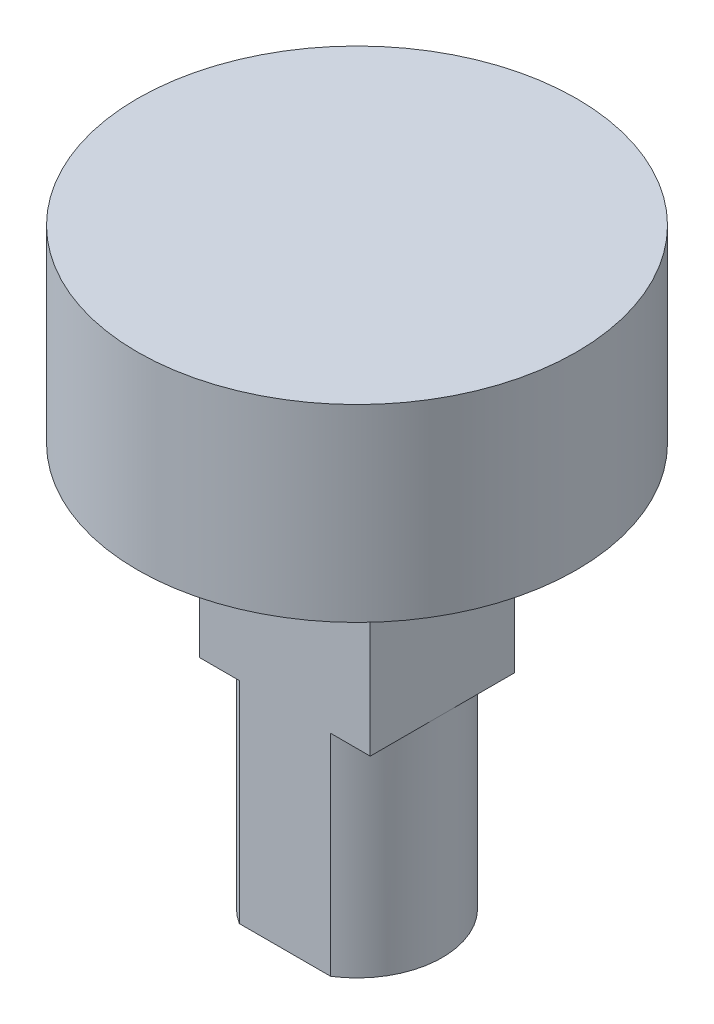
from build123d import *

# Parameters (mm, degrees)
SKETCH1_W      = 11.938
SKETCH1_H      = 10.0838
EXTRUDE1_DEPTH = 8.89
EXTRUDE2_DEPTH = 14.732
SKETCH3_R      = 5.1943
EXTRUDE3_DEPTH = 4.572
SKETCH5_R      = 15.367
EXTRUDE7_DEPTH = 13.208


with BuildPart() as part:
    # Sketch1 → Extrude1 (new body)
    with BuildSketch(Plane(origin=(0, 0, 0), x_dir=(1, 0, 0), z_dir=(0, 1, 0))):
        Rectangle(SKETCH1_W, SKETCH1_H)
    extrude(amount=EXTRUDE1_DEPTH)

    # Sketch2 → Extrude2 (add)
    with BuildSketch(Plane.XZ):
        with BuildLine():
            Line((-3.19502823, 5.0419), (3.19502823, 5.0419))
            ThreePointArc((3.19502823, 5.0419), (5.969, 0), (3.19502823, -5.0419))
            Line((3.19502823, -5.0419), (-3.19502823, -5.0419))
            ThreePointArc((-3.19502823, -5.0419), (-5.969, 0), (-3.19502823, 5.0419))
        make_face()
    extrude(amount=EXTRUDE2_DEPTH)

    # Sketch3 → Extrude3 (add)
    with BuildSketch(Plane(origin=(0, 8.89, 0), x_dir=(1, 0, 0), z_dir=(0, 1, 0))):
        with Locations(Location((0, 0, 0), (0, 0, 76.086570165))):
            Circle(SKETCH3_R)
    extrude(amount=EXTRUDE3_DEPTH)

    # Sketch5 → Extrude7 (add)
    with BuildSketch(Plane(origin=(0, 13.462, 0), x_dir=(1, 0, 0), z_dir=(0, 1, 0))):
        with Locations(Location((0, 0, 0), (0, 0, 90))):
            Circle(SKETCH5_R)
    extrude(amount=EXTRUDE7_DEPTH)


solid = part.part
